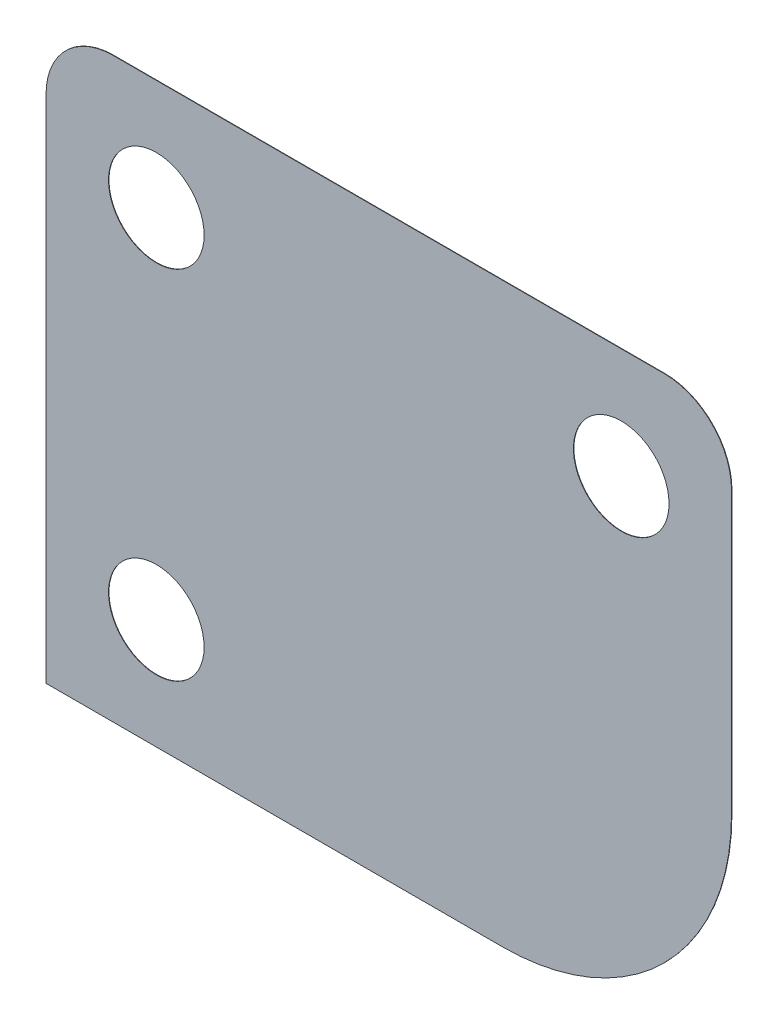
ISO-10303-21;
HEADER;
FILE_DESCRIPTION(('STEP AP214'),'2;1');
FILE_NAME('part.step','',(''),(''),'','','');
FILE_SCHEMA(('AUTOMOTIVE_DESIGN { 1 0 10303 214 1 1 1 1 }'));
ENDSEC;
DATA;
#1=APPLICATION_CONTEXT('core data for automotive mechanical design processes');
#2=APPLICATION_PROTOCOL_DEFINITION('international standard','automotive_design',2000,#1);
#3=PRODUCT_CONTEXT('',#1,'mechanical');
#4=PRODUCT('Part','Part','',(#3));
#5=PRODUCT_RELATED_PRODUCT_CATEGORY('part','',(#4));
#6=PRODUCT_DEFINITION_FORMATION('','',#4);
#7=PRODUCT_DEFINITION_CONTEXT('part definition',#1,'design');
#8=PRODUCT_DEFINITION('design','',#6,#7);
#9=PRODUCT_DEFINITION_SHAPE('','',#8);
#10=(LENGTH_UNIT() NAMED_UNIT(*) SI_UNIT(.MILLI.,.METRE.));
#11=(NAMED_UNIT(*) PLANE_ANGLE_UNIT() SI_UNIT($,.RADIAN.));
#12=(NAMED_UNIT(*) SI_UNIT($,.STERADIAN.) SOLID_ANGLE_UNIT());
#13=UNCERTAINTY_MEASURE_WITH_UNIT(LENGTH_MEASURE(1.E-05),#10,'distance_accuracy_value','');
#14=(GEOMETRIC_REPRESENTATION_CONTEXT(3) GLOBAL_UNCERTAINTY_ASSIGNED_CONTEXT((#13)) GLOBAL_UNIT_ASSIGNED_CONTEXT((#10,
#11,#12)) REPRESENTATION_CONTEXT('',''));
#15=CARTESIAN_POINT('',(0.,0.,0.));
#16=DIRECTION('',(0.,0.,1.));
#17=DIRECTION('',(1.,0.,0.));
#18=AXIS2_PLACEMENT_3D('',#15,#16,#17);
#19=CARTESIAN_POINT('',(-518.026152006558,-26.6178402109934,0.0254000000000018));
#20=DIRECTION('',(0.,0.,-1.));
#21=DIRECTION('',(-1.,0.,0.));
#22=AXIS2_PLACEMENT_3D('',#19,#20,#21);
#23=CYLINDRICAL_SURFACE('',#22,13.462);
#24=CARTESIAN_POINT('',(-518.026152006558,-26.6178402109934,0.));
#25=DIRECTION('',(0.,0.,1.));
#26=DIRECTION('',(1.,0.,0.));
#27=AXIS2_PLACEMENT_3D('',#24,#25,#26);
#28=CIRCLE('',#27,13.462);
#29=CARTESIAN_POINT('',(-518.026152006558,-40.0798402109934,0.));
#30=VERTEX_POINT('',#29);
#31=CARTESIAN_POINT('',(-504.564152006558,-26.6178402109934,0.));
#32=VERTEX_POINT('',#31);
#33=EDGE_CURVE('E141',#30,#32,#28,.T.);
#34=ORIENTED_EDGE('',*,*,#33,.T.);
#35=DIRECTION('',(0.,0.,-1.));
#36=VECTOR('',#35,1.);
#37=CARTESIAN_POINT('',(-504.564152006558,-26.6178402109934,0.0254000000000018));
#38=LINE('',#37,#36);
#39=CARTESIAN_POINT('',(-504.564152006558,-26.6178402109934,0.0254000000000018));
#40=VERTEX_POINT('',#39);
#41=EDGE_CURVE('E11',#40,#32,#38,.T.);
#42=ORIENTED_EDGE('',*,*,#41,.F.);
#43=CARTESIAN_POINT('',(-518.026152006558,-26.6178402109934,0.0254000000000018));
#44=DIRECTION('',(0.,0.,1.));
#45=DIRECTION('',(1.,0.,0.));
#46=AXIS2_PLACEMENT_3D('',#43,#44,#45);
#47=CIRCLE('',#46,13.462);
#48=CARTESIAN_POINT('',(-518.026152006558,-40.0798402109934,0.0254000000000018));
#49=VERTEX_POINT('',#48);
#50=EDGE_CURVE('E161',#49,#40,#47,.T.);
#51=ORIENTED_EDGE('',*,*,#50,.F.);
#52=DIRECTION('',(0.,0.,-1.));
#53=VECTOR('',#52,1.);
#54=CARTESIAN_POINT('',(-518.026152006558,-40.0798402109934,0.0254000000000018));
#55=LINE('',#54,#53);
#56=EDGE_CURVE('E137',#49,#30,#55,.T.);
#57=ORIENTED_EDGE('',*,*,#56,.T.);
#58=EDGE_LOOP('',(#34,#42,#51,#57));
#59=FACE_BOUND('',#58,.T.);
#60=ADVANCED_FACE('F45',(#59),#23,.T.);
#61=CARTESIAN_POINT('',(-504.564152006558,-26.6178402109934,0.0254000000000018));
#62=DIRECTION('',(-1.,0.,0.));
#63=DIRECTION('',(0.,-1.,0.));
#64=AXIS2_PLACEMENT_3D('',#61,#62,#63);
#65=PLANE('',#64);
#66=DIRECTION('',(0.,1.,0.));
#67=VECTOR('',#66,1.);
#68=CARTESIAN_POINT('',(-504.564152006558,-26.6178402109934,0.));
#69=LINE('',#68,#67);
#70=CARTESIAN_POINT('',(-504.564152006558,-10.1078402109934,0.));
#71=VERTEX_POINT('',#70);
#72=EDGE_CURVE('E145',#32,#71,#69,.T.);
#73=ORIENTED_EDGE('',*,*,#72,.T.);
#74=DIRECTION('',(0.,0.,-1.));
#75=VECTOR('',#74,1.);
#76=CARTESIAN_POINT('',(-504.564152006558,-10.1078402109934,0.0254000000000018));
#77=LINE('',#76,#75);
#78=CARTESIAN_POINT('',(-504.564152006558,-10.1078402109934,0.0254000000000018));
#79=VERTEX_POINT('',#78);
#80=EDGE_CURVE('E54',#79,#71,#77,.T.);
#81=ORIENTED_EDGE('',*,*,#80,.F.);
#82=DIRECTION('',(0.,1.,0.));
#83=VECTOR('',#82,1.);
#84=CARTESIAN_POINT('',(-504.564152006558,-26.6178402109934,0.0254000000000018));
#85=LINE('',#84,#83);
#86=EDGE_CURVE('E102',#40,#79,#85,.T.);
#87=ORIENTED_EDGE('',*,*,#86,.F.);
#88=ORIENTED_EDGE('',*,*,#41,.T.);
#89=EDGE_LOOP('',(#73,#81,#87,#88));
#90=FACE_BOUND('',#89,.T.);
#91=ADVANCED_FACE('F250',(#90),#65,.F.);
#92=CARTESIAN_POINT('',(-508.501152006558,-10.1078402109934,0.0254000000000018));
#93=DIRECTION('',(0.,0.,-1.));
#94=DIRECTION('',(-1.,0.,0.));
#95=AXIS2_PLACEMENT_3D('',#92,#93,#94);
#96=CYLINDRICAL_SURFACE('',#95,3.93700000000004);
#97=CARTESIAN_POINT('',(-508.501152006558,-10.1078402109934,0.));
#98=DIRECTION('',(0.,0.,1.));
#99=DIRECTION('',(1.,0.,0.));
#100=AXIS2_PLACEMENT_3D('',#97,#98,#99);
#101=CIRCLE('',#100,3.93700000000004);
#102=CARTESIAN_POINT('',(-508.501152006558,-6.17084021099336,0.));
#103=VERTEX_POINT('',#102);
#104=EDGE_CURVE('E149',#71,#103,#101,.T.);
#105=ORIENTED_EDGE('',*,*,#104,.T.);
#106=DIRECTION('',(0.,0.,-1.));
#107=VECTOR('',#106,1.);
#108=CARTESIAN_POINT('',(-508.501152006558,-6.17084021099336,0.0254000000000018));
#109=LINE('',#108,#107);
#110=CARTESIAN_POINT('',(-508.501152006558,-6.17084021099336,0.0254000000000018));
#111=VERTEX_POINT('',#110);
#112=EDGE_CURVE('E168',#111,#103,#109,.T.);
#113=ORIENTED_EDGE('',*,*,#112,.F.);
#114=CARTESIAN_POINT('',(-508.501152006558,-10.1078402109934,0.0254000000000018));
#115=DIRECTION('',(0.,0.,1.));
#116=DIRECTION('',(1.,0.,0.));
#117=AXIS2_PLACEMENT_3D('',#114,#115,#116);
#118=CIRCLE('',#117,3.93700000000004);
#119=EDGE_CURVE('E179',#79,#111,#118,.T.);
#120=ORIENTED_EDGE('',*,*,#119,.F.);
#121=ORIENTED_EDGE('',*,*,#80,.T.);
#122=EDGE_LOOP('',(#105,#113,#120,#121));
#123=FACE_BOUND('',#122,.T.);
#124=ADVANCED_FACE('F177',(#123),#96,.T.);
#125=CARTESIAN_POINT('',(-508.501152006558,-6.1708402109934,0.0254000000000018));
#126=DIRECTION('',(0.,-1.,0.));
#127=DIRECTION('',(1.,0.,0.));
#128=AXIS2_PLACEMENT_3D('',#125,#126,#127);
#129=PLANE('',#128);
#130=DIRECTION('',(-1.,0.,0.));
#131=VECTOR('',#130,1.);
#132=CARTESIAN_POINT('',(-508.501152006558,-6.1708402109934,0.));
#133=LINE('',#132,#131);
#134=CARTESIAN_POINT('',(-540.886152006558,-6.17084021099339,0.));
#135=VERTEX_POINT('',#134);
#136=EDGE_CURVE('E152',#103,#135,#133,.T.);
#137=ORIENTED_EDGE('',*,*,#136,.T.);
#138=DIRECTION('',(0.,0.,-1.));
#139=VECTOR('',#138,1.);
#140=CARTESIAN_POINT('',(-540.886152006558,-6.17084021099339,0.0254000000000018));
#141=LINE('',#140,#139);
#142=CARTESIAN_POINT('',(-540.886152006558,-6.17084021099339,0.0254000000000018));
#143=VERTEX_POINT('',#142);
#144=EDGE_CURVE('E129',#143,#135,#141,.T.);
#145=ORIENTED_EDGE('',*,*,#144,.F.);
#146=DIRECTION('',(-1.,0.,0.));
#147=VECTOR('',#146,1.);
#148=CARTESIAN_POINT('',(-508.501152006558,-6.1708402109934,0.0254000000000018));
#149=LINE('',#148,#147);
#150=EDGE_CURVE('E118',#111,#143,#149,.T.);
#151=ORIENTED_EDGE('',*,*,#150,.F.);
#152=ORIENTED_EDGE('',*,*,#112,.T.);
#153=EDGE_LOOP('',(#137,#145,#151,#152));
#154=FACE_BOUND('',#153,.T.);
#155=ADVANCED_FACE('F185',(#154),#129,.F.);
#156=CARTESIAN_POINT('',(-540.886152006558,-10.1078402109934,0.0254000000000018));
#157=DIRECTION('',(0.,0.,-1.));
#158=DIRECTION('',(-1.,0.,0.));
#159=AXIS2_PLACEMENT_3D('',#156,#157,#158);
#160=CYLINDRICAL_SURFACE('',#159,3.93700000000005);
#161=CARTESIAN_POINT('',(-540.886152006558,-10.1078402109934,0.));
#162=DIRECTION('',(0.,0.,1.));
#163=DIRECTION('',(1.,0.,0.));
#164=AXIS2_PLACEMENT_3D('',#161,#162,#163);
#165=CIRCLE('',#164,3.93700000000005);
#166=CARTESIAN_POINT('',(-544.823152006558,-10.1078402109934,0.));
#167=VERTEX_POINT('',#166);
#168=EDGE_CURVE('E127',#135,#167,#165,.T.);
#169=ORIENTED_EDGE('',*,*,#168,.T.);
#170=DIRECTION('',(0.,0.,-1.));
#171=VECTOR('',#170,1.);
#172=CARTESIAN_POINT('',(-544.823152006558,-10.1078402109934,0.0254000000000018));
#173=LINE('',#172,#171);
#174=CARTESIAN_POINT('',(-544.823152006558,-10.1078402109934,0.0254000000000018));
#175=VERTEX_POINT('',#174);
#176=EDGE_CURVE('E124',#175,#167,#173,.T.);
#177=ORIENTED_EDGE('',*,*,#176,.F.);
#178=CARTESIAN_POINT('',(-540.886152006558,-10.1078402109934,0.0254000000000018));
#179=DIRECTION('',(0.,0.,1.));
#180=DIRECTION('',(1.,0.,0.));
#181=AXIS2_PLACEMENT_3D('',#178,#179,#180);
#182=CIRCLE('',#181,3.93700000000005);
#183=EDGE_CURVE('E112',#143,#175,#182,.T.);
#184=ORIENTED_EDGE('',*,*,#183,.F.);
#185=ORIENTED_EDGE('',*,*,#144,.T.);
#186=EDGE_LOOP('',(#169,#177,#184,#185));
#187=FACE_BOUND('',#186,.T.);
#188=ADVANCED_FACE('F125',(#187),#160,.T.);
#189=CARTESIAN_POINT('',(-544.823152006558,-10.1078402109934,0.0254000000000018));
#190=DIRECTION('',(1.,0.,0.));
#191=DIRECTION('',(0.,0.,-1.));
#192=AXIS2_PLACEMENT_3D('',#189,#190,#191);
#193=PLANE('',#192);
#194=DIRECTION('',(0.,-1.,0.));
#195=VECTOR('',#194,1.);
#196=CARTESIAN_POINT('',(-544.823152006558,-10.1078402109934,0.));
#197=LINE('',#196,#195);
#198=CARTESIAN_POINT('',(-544.823152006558,-40.0798402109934,0.));
#199=VERTEX_POINT('',#198);
#200=EDGE_CURVE('E88',#167,#199,#197,.T.);
#201=ORIENTED_EDGE('',*,*,#200,.T.);
#202=DIRECTION('',(0.,0.,-1.));
#203=VECTOR('',#202,1.);
#204=CARTESIAN_POINT('',(-544.823152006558,-40.0798402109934,0.0254000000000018));
#205=LINE('',#204,#203);
#206=CARTESIAN_POINT('',(-544.823152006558,-40.0798402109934,0.0254000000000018));
#207=VERTEX_POINT('',#206);
#208=EDGE_CURVE('E130',#207,#199,#205,.T.);
#209=ORIENTED_EDGE('',*,*,#208,.F.);
#210=DIRECTION('',(0.,-1.,0.));
#211=VECTOR('',#210,1.);
#212=CARTESIAN_POINT('',(-544.823152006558,-10.1078402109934,0.0254000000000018));
#213=LINE('',#212,#211);
#214=EDGE_CURVE('E116',#175,#207,#213,.T.);
#215=ORIENTED_EDGE('',*,*,#214,.F.);
#216=ORIENTED_EDGE('',*,*,#176,.T.);
#217=EDGE_LOOP('',(#201,#209,#215,#216));
#218=FACE_BOUND('',#217,.T.);
#219=ADVANCED_FACE('F132',(#218),#193,.F.);
#220=CARTESIAN_POINT('',(-544.823152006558,-40.0798402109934,0.0254000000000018));
#221=DIRECTION('',(0.,1.,0.));
#222=DIRECTION('',(-1.,0.,0.));
#223=AXIS2_PLACEMENT_3D('',#220,#221,#222);
#224=PLANE('',#223);
#225=DIRECTION('',(1.,0.,0.));
#226=VECTOR('',#225,1.);
#227=CARTESIAN_POINT('',(-544.823152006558,-40.0798402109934,0.));
#228=LINE('',#227,#226);
#229=EDGE_CURVE('E94',#199,#30,#228,.T.);
#230=ORIENTED_EDGE('',*,*,#229,.T.);
#231=ORIENTED_EDGE('',*,*,#56,.F.);
#232=DIRECTION('',(1.,0.,0.));
#233=VECTOR('',#232,1.);
#234=CARTESIAN_POINT('',(-544.823152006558,-40.0798402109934,0.0254000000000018));
#235=LINE('',#234,#233);
#236=EDGE_CURVE('E62',#207,#49,#235,.T.);
#237=ORIENTED_EDGE('',*,*,#236,.F.);
#238=ORIENTED_EDGE('',*,*,#208,.T.);
#239=EDGE_LOOP('',(#230,#231,#237,#238));
#240=FACE_BOUND('',#239,.T.);
#241=ADVANCED_FACE('F231',(#240),#224,.F.);
#242=CARTESIAN_POINT('',(-518.026152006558,-26.6178402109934,0.0254000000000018));
#243=DIRECTION('',(0.,0.,1.));
#244=DIRECTION('',(1.,0.,0.));
#245=AXIS2_PLACEMENT_3D('',#242,#243,#244);
#246=PLANE('',#245);
#247=CARTESIAN_POINT('',(-538.346152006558,-12.6478402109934,0.0254000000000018));
#248=DIRECTION('',(0.,0.,1.));
#249=DIRECTION('',(1.,0.,0.));
#250=AXIS2_PLACEMENT_3D('',#247,#248,#249);
#251=CIRCLE('',#250,2.80670000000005);
#252=CARTESIAN_POINT('',(-535.539452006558,-12.6478402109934,0.0254000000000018));
#253=VERTEX_POINT('',#252);
#254=EDGE_CURVE('E210',#253,#253,#251,.T.);
#255=ORIENTED_EDGE('',*,*,#254,.F.);
#256=EDGE_LOOP('',(#255));
#257=FACE_BOUND('',#256,.T.);
#258=CARTESIAN_POINT('',(-538.346152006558,-33.6028402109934,0.0254000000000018));
#259=DIRECTION('',(0.,0.,1.));
#260=DIRECTION('',(1.,0.,0.));
#261=AXIS2_PLACEMENT_3D('',#258,#259,#260);
#262=CIRCLE('',#261,2.80670000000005);
#263=CARTESIAN_POINT('',(-535.539452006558,-33.6028402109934,0.0254000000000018));
#264=VERTEX_POINT('',#263);
#265=EDGE_CURVE('E202',#264,#264,#262,.T.);
#266=ORIENTED_EDGE('',*,*,#265,.F.);
#267=EDGE_LOOP('',(#266));
#268=FACE_BOUND('',#267,.T.);
#269=CARTESIAN_POINT('',(-511.041152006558,-12.6478402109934,0.0254000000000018));
#270=DIRECTION('',(0.,0.,1.));
#271=DIRECTION('',(1.,0.,0.));
#272=AXIS2_PLACEMENT_3D('',#269,#270,#271);
#273=CIRCLE('',#272,2.80670000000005);
#274=CARTESIAN_POINT('',(-508.234452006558,-12.6478402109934,0.0254000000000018));
#275=VERTEX_POINT('',#274);
#276=EDGE_CURVE('E146',#275,#275,#273,.T.);
#277=ORIENTED_EDGE('',*,*,#276,.F.);
#278=EDGE_LOOP('',(#277));
#279=FACE_BOUND('',#278,.T.);
#280=ORIENTED_EDGE('',*,*,#50,.T.);
#281=ORIENTED_EDGE('',*,*,#86,.T.);
#282=ORIENTED_EDGE('',*,*,#119,.T.);
#283=ORIENTED_EDGE('',*,*,#150,.T.);
#284=ORIENTED_EDGE('',*,*,#183,.T.);
#285=ORIENTED_EDGE('',*,*,#214,.T.);
#286=ORIENTED_EDGE('',*,*,#236,.T.);
#287=EDGE_LOOP('',(#280,#281,#282,#283,#284,#285,#286));
#288=FACE_BOUND('',#287,.T.);
#289=ADVANCED_FACE('F114',(#257,#268,#279,#288),#246,.T.);
#290=CARTESIAN_POINT('',(-518.026152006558,-26.6178402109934,0.));
#291=DIRECTION('',(0.,0.,1.));
#292=DIRECTION('',(1.,0.,0.));
#293=AXIS2_PLACEMENT_3D('',#290,#291,#292);
#294=PLANE('',#293);
#295=CARTESIAN_POINT('',(-538.346152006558,-12.6478402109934,0.));
#296=DIRECTION('',(0.,0.,1.));
#297=DIRECTION('',(1.,0.,0.));
#298=AXIS2_PLACEMENT_3D('',#295,#296,#297);
#299=CIRCLE('',#298,2.80670000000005);
#300=CARTESIAN_POINT('',(-535.539452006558,-12.6478402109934,0.));
#301=VERTEX_POINT('',#300);
#302=EDGE_CURVE('E214',#301,#301,#299,.T.);
#303=ORIENTED_EDGE('',*,*,#302,.T.);
#304=EDGE_LOOP('',(#303));
#305=FACE_BOUND('',#304,.T.);
#306=CARTESIAN_POINT('',(-538.346152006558,-33.6028402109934,0.));
#307=DIRECTION('',(0.,0.,1.));
#308=DIRECTION('',(1.,0.,0.));
#309=AXIS2_PLACEMENT_3D('',#306,#307,#308);
#310=CIRCLE('',#309,2.80670000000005);
#311=CARTESIAN_POINT('',(-535.539452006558,-33.6028402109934,0.));
#312=VERTEX_POINT('',#311);
#313=EDGE_CURVE('E206',#312,#312,#310,.T.);
#314=ORIENTED_EDGE('',*,*,#313,.T.);
#315=EDGE_LOOP('',(#314));
#316=FACE_BOUND('',#315,.T.);
#317=CARTESIAN_POINT('',(-511.041152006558,-12.6478402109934,0.));
#318=DIRECTION('',(0.,0.,1.));
#319=DIRECTION('',(1.,0.,0.));
#320=AXIS2_PLACEMENT_3D('',#317,#318,#319);
#321=CIRCLE('',#320,2.80670000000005);
#322=CARTESIAN_POINT('',(-508.234452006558,-12.6478402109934,0.));
#323=VERTEX_POINT('',#322);
#324=EDGE_CURVE('E198',#323,#323,#321,.T.);
#325=ORIENTED_EDGE('',*,*,#324,.T.);
#326=EDGE_LOOP('',(#325));
#327=FACE_BOUND('',#326,.T.);
#328=ORIENTED_EDGE('',*,*,#33,.F.);
#329=ORIENTED_EDGE('',*,*,#229,.F.);
#330=ORIENTED_EDGE('',*,*,#200,.F.);
#331=ORIENTED_EDGE('',*,*,#168,.F.);
#332=ORIENTED_EDGE('',*,*,#136,.F.);
#333=ORIENTED_EDGE('',*,*,#104,.F.);
#334=ORIENTED_EDGE('',*,*,#72,.F.);
#335=EDGE_LOOP('',(#328,#329,#330,#331,#332,#333,#334));
#336=FACE_BOUND('',#335,.T.);
#337=ADVANCED_FACE('F183',(#305,#316,#327,#336),#294,.F.);
#338=CARTESIAN_POINT('',(-511.041152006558,-12.6478402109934,0.0254000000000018));
#339=DIRECTION('',(0.,0.,1.));
#340=DIRECTION('',(1.,0.,0.));
#341=AXIS2_PLACEMENT_3D('',#338,#339,#340);
#342=CYLINDRICAL_SURFACE('',#341,2.80670000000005);
#343=ORIENTED_EDGE('',*,*,#324,.F.);
#344=EDGE_LOOP('',(#343));
#345=FACE_BOUND('',#344,.T.);
#346=ORIENTED_EDGE('',*,*,#276,.T.);
#347=EDGE_LOOP('',(#346));
#348=FACE_BOUND('',#347,.T.);
#349=ADVANCED_FACE('F237',(#345,#348),#342,.F.);
#350=CARTESIAN_POINT('',(-538.346152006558,-33.6028402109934,0.0254000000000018));
#351=DIRECTION('',(0.,0.,1.));
#352=DIRECTION('',(1.,0.,0.));
#353=AXIS2_PLACEMENT_3D('',#350,#351,#352);
#354=CYLINDRICAL_SURFACE('',#353,2.80670000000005);
#355=ORIENTED_EDGE('',*,*,#313,.F.);
#356=EDGE_LOOP('',(#355));
#357=FACE_BOUND('',#356,.T.);
#358=ORIENTED_EDGE('',*,*,#265,.T.);
#359=EDGE_LOOP('',(#358));
#360=FACE_BOUND('',#359,.T.);
#361=ADVANCED_FACE('F225',(#357,#360),#354,.F.);
#362=CARTESIAN_POINT('',(-538.346152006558,-12.6478402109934,0.0254000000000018));
#363=DIRECTION('',(0.,0.,1.));
#364=DIRECTION('',(1.,0.,0.));
#365=AXIS2_PLACEMENT_3D('',#362,#363,#364);
#366=CYLINDRICAL_SURFACE('',#365,2.80670000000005);
#367=ORIENTED_EDGE('',*,*,#302,.F.);
#368=EDGE_LOOP('',(#367));
#369=FACE_BOUND('',#368,.T.);
#370=ORIENTED_EDGE('',*,*,#254,.T.);
#371=EDGE_LOOP('',(#370));
#372=FACE_BOUND('',#371,.T.);
#373=ADVANCED_FACE('F222',(#369,#372),#366,.F.);
#374=CLOSED_SHELL('',(#60,#91,#124,#155,#188,#219,#241,#289,#337,#349,#361,#373));
#375=MANIFOLD_SOLID_BREP('B2',#374);
#376=ADVANCED_BREP_SHAPE_REPRESENTATION('',(#18,#375),#14);
#377=SHAPE_DEFINITION_REPRESENTATION(#9,#376);
ENDSEC;
END-ISO-10303-21;
